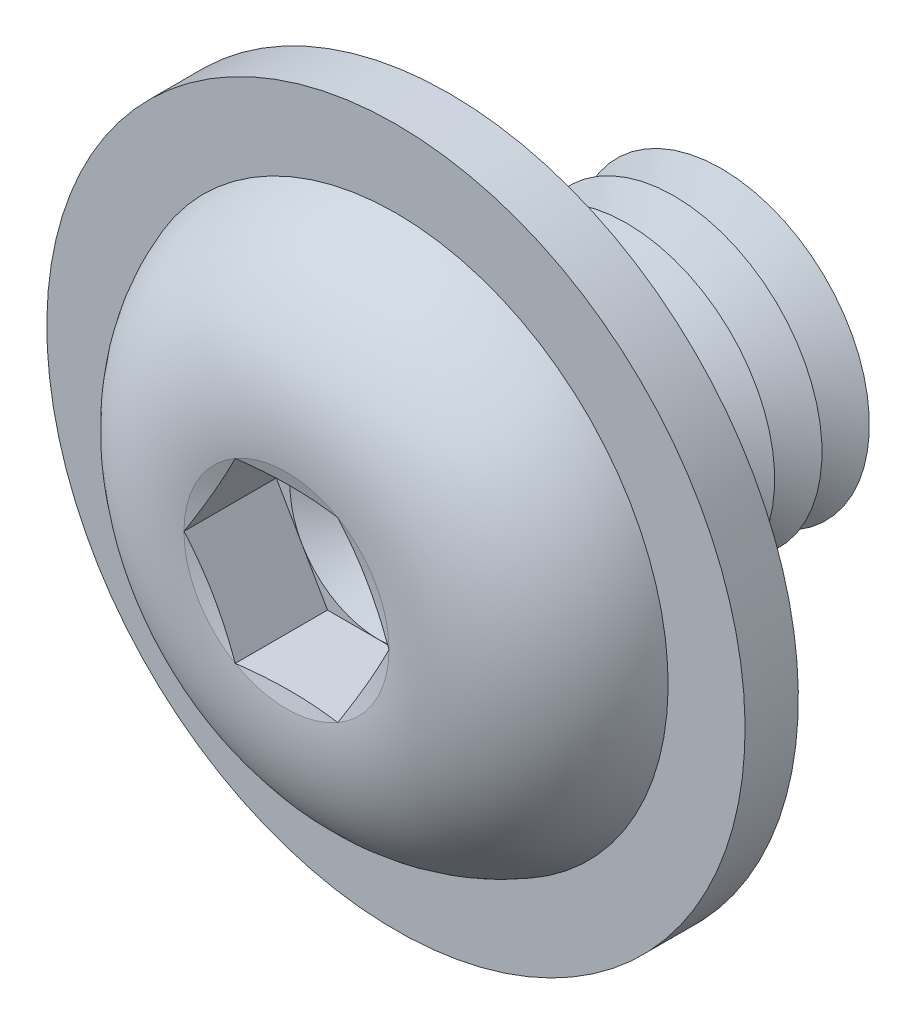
from build123d import *

# Parameters (mm, degrees)
FILLET1_R           = 0.4
LPATTERN1_COUNT     = 6
LPATTERN1_PITCH     = 0.8
CUT_EXTRUDE1_DEPTH  = 1.56
SKETCH5_R           = 5.9
SKETCH5_R_2         = 2.9
BOSS_EXTRUDE1_DEPTH = 0.9


with BuildPart() as part:
    # Sketch1 → Revolve1 (revolve)
    with BuildSketch(Plane(origin=(0, 0, 0), x_dir=(0, 0, -1), z_dir=(1, 0, 0))):
        with BuildLine():
            Line((0, 2.5), (0, 4.75))
            ThreePointArc((0, 4.75), (-2.041477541, 3.848329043), (-2.75, 1.73205))
            Line((-2.75, 1.73205), (-2.517949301, 0.866025))
            Line((-2.517949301, 0.866025), (-2.75, 0.866025))
            Line((-2.75, 0.866025), (-2.75, 0))
            Line((-2.75, 0), (5, 0))
            Line((5, 0), (5, 2.5))
            Line((5, 2.5), (0, 2.5))
        make_face()
    revolve(axis=Axis((0, 0, -5), (0, 0, 1)))

    # Fillet1
    fillet1_edges = [part.edges().sort_by_distance(p)[0] for p in [
        (0, -2.5, 0),
    ]]
    fillet(fillet1_edges, radius=FILLET1_R)

    # Sketch2 → Cut-Revolve1 (revolve, cut)
    with BuildSketch(Plane(origin=(0, 0, 0), x_dir=(0, 0, -1), z_dir=(1, 0, 0))):
        Polygon((4.6, 2.5), (5.4, 2.5), (5, 1.807179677), align=None)
    cut_revolve1 = revolve(axis=Axis((0, 0, -5), (0, 0, -1)), mode=Mode.SUBTRACT)

    # LPattern1: Cut-Revolve1 ×6
    with Locations(*[(0, 0, i * LPATTERN1_PITCH) for i in range(1, LPATTERN1_COUNT)]):
        add(cut_revolve1, mode=Mode.SUBTRACT)

    # Sketch3 → Cut-Extrude1 (cut)
    with BuildSketch(Plane.XY.offset(2.75)):
        Polygon((0.866025, 1.499999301), (-0.866025, 1.499999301), (-1.73205, 0), (-0.866025, -1.499999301), (0.866025, -1.499999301), (1.73205, 0), align=None)
    extrude(amount=-CUT_EXTRUDE1_DEPTH, mode=Mode.SUBTRACT)

    # Cut-Extrude2 cone 1 section (on through the dimple's axis) → Cut-Extrude2 (revolve, cut)
    with BuildSketch(Plane(origin=(0, 0, 1.19), x_dir=(0, -1, 0), z_dir=(1, 0, 0))):
        Polygon((0, 0), (1.499999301, 0), (0, 0.866025), align=None)
    revolve(axis=Axis((0, 0, 1.19), (0, 0, -1)), mode=Mode.SUBTRACT)

    # Sketch5 → Boss-Extrude1 (add)
    with BuildSketch(Plane(origin=(0, 0, 0), x_dir=(-1, 0, 0), z_dir=(0, 0, -1))):
        with Locations(Location((0, 0, 0), (0, 0, 90))):
            Circle(SKETCH5_R)
        Circle(SKETCH5_R_2, mode=Mode.SUBTRACT)
    extrude(amount=-BOSS_EXTRUDE1_DEPTH)


solid = part.part
